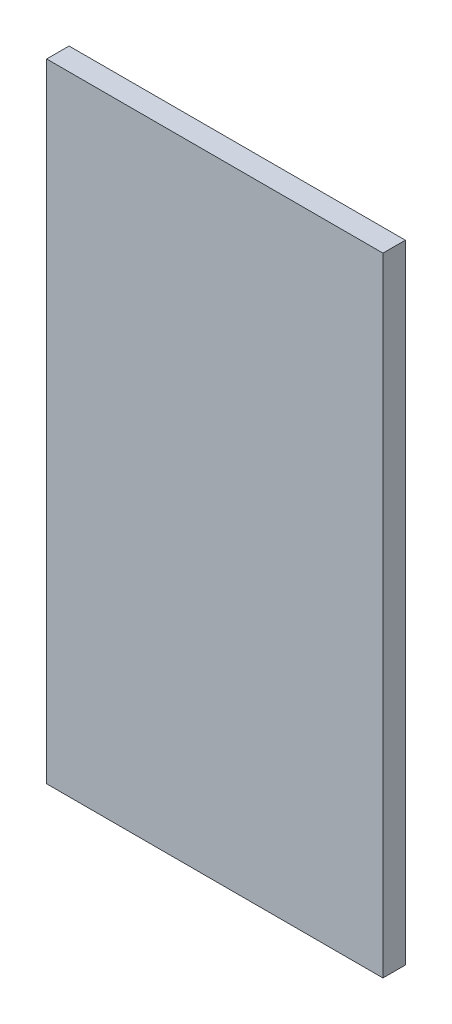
from build123d import *

# Parameters (mm, degrees)
SKETCH1_W      = 190.5
SKETCH1_H      = 355.6
EXTRUDE1_DEPTH = 12.7


with BuildPart() as part:
    # Sketch1 → Extrude1 (new body)
    with BuildSketch(Plane.XY):
        with Locations((95.25, 177.8)):
            Rectangle(SKETCH1_W, SKETCH1_H)
    extrude(amount=EXTRUDE1_DEPTH)


solid = part.part
